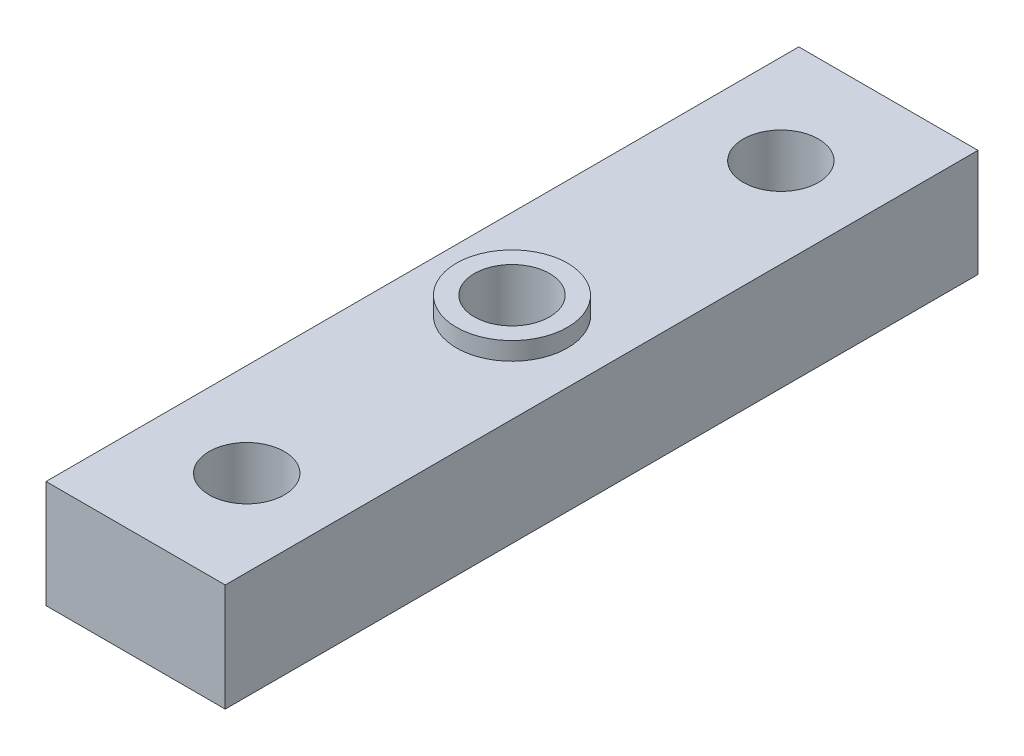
from build123d import *

# Parameters (mm, degrees)
SKETCH_1_W      = 10
SKETCH_1_H      = 41.998668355
SKETCH_1_R      = 2.1
EXTRUDE_1_DEPTH = 6
SKETCH_2_R      = 3.1
SKETCH_2_R_2    = 2.1
EXTRUDE_2_DEPTH = 1


with BuildPart() as part:
    # Sketch 1 → Extrude 1 (new body)
    with BuildSketch(Plane(origin=(0, 0, 0), x_dir=(1, 0, 0), z_dir=(0, 1, 0))):
        with Locations((5, 20.999334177)):
            Rectangle(SKETCH_1_W, SKETCH_1_H)
        with Locations(Location((5.199868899, 6, 0), (0, 0, 270))):
            Circle(SKETCH_1_R, mode=Mode.SUBTRACT)
        with Locations(Location((5, 20.998668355, 0), (0, 0, 270))):
            Circle(SKETCH_1_R, mode=Mode.SUBTRACT)
        with Locations(Location((5, 35.998668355, 0), (0, 0, 270))):
            Circle(SKETCH_1_R, mode=Mode.SUBTRACT)
    extrude(amount=EXTRUDE_1_DEPTH)

    # Sketch 2 → Extrude 2 (add)
    with BuildSketch(Plane(origin=(0, 6, 0), x_dir=(1, 0, 0), z_dir=(0, 1, 0))):
        with Locations(Location((5, 20.998668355, 0), (0, 0, 90))):
            Circle(SKETCH_2_R)
        with Locations(Location((5, 20.998668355, 0), (0, 0, 270))):
            Circle(SKETCH_2_R_2, mode=Mode.SUBTRACT)
    extrude(amount=EXTRUDE_2_DEPTH)


solid = part.part
